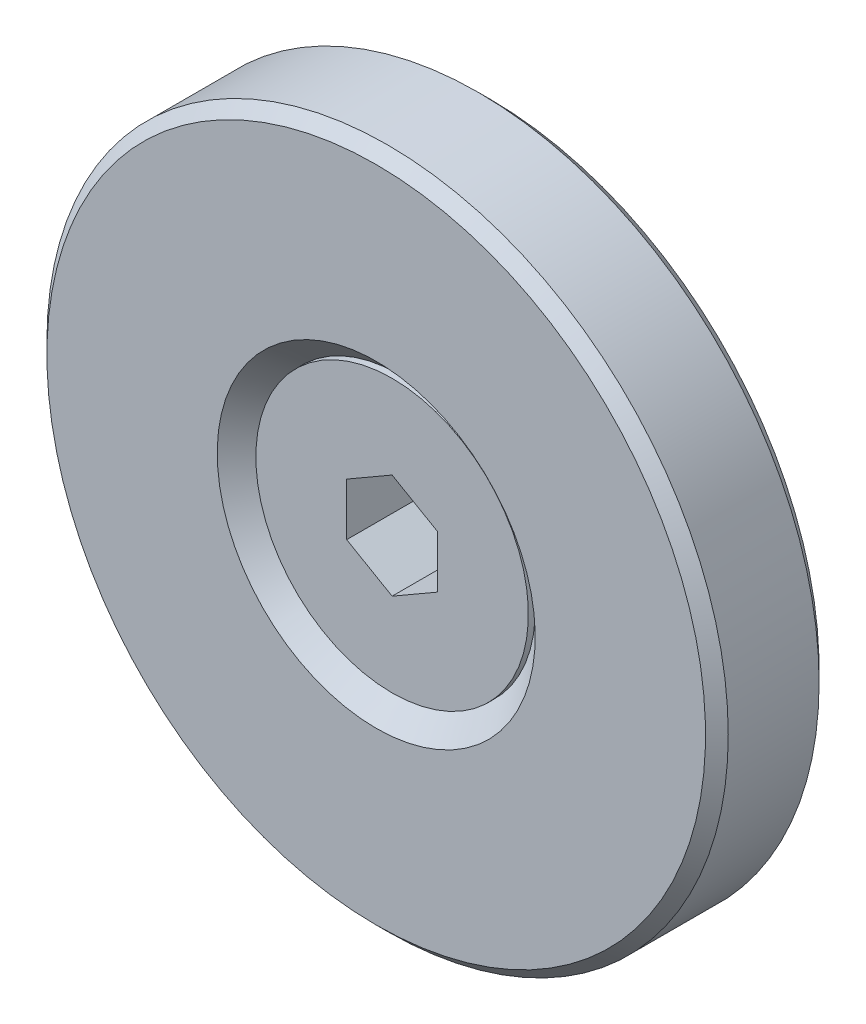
ISO-10303-21;
HEADER;
FILE_DESCRIPTION(('STEP AP214'),'2;1');
FILE_NAME('part.step','',(''),(''),'','','');
FILE_SCHEMA(('AUTOMOTIVE_DESIGN { 1 0 10303 214 1 1 1 1 }'));
ENDSEC;
DATA;
#1=APPLICATION_CONTEXT('core data for automotive mechanical design processes');
#2=APPLICATION_PROTOCOL_DEFINITION('international standard','automotive_design',2000,#1);
#3=PRODUCT_CONTEXT('',#1,'mechanical');
#4=PRODUCT('Part','Part','',(#3));
#5=PRODUCT_RELATED_PRODUCT_CATEGORY('part','',(#4));
#6=PRODUCT_DEFINITION_FORMATION('','',#4);
#7=PRODUCT_DEFINITION_CONTEXT('part definition',#1,'design');
#8=PRODUCT_DEFINITION('design','',#6,#7);
#9=PRODUCT_DEFINITION_SHAPE('','',#8);
#10=(LENGTH_UNIT() NAMED_UNIT(*) SI_UNIT(.MILLI.,.METRE.));
#11=(NAMED_UNIT(*) PLANE_ANGLE_UNIT() SI_UNIT($,.RADIAN.));
#12=(NAMED_UNIT(*) SI_UNIT($,.STERADIAN.) SOLID_ANGLE_UNIT());
#13=UNCERTAINTY_MEASURE_WITH_UNIT(LENGTH_MEASURE(1.E-05),#10,'distance_accuracy_value','');
#14=(GEOMETRIC_REPRESENTATION_CONTEXT(3) GLOBAL_UNCERTAINTY_ASSIGNED_CONTEXT((#13)) GLOBAL_UNIT_ASSIGNED_CONTEXT((#10,
#11,#12)) REPRESENTATION_CONTEXT('',''));
#15=CARTESIAN_POINT('',(0.,0.,0.));
#16=DIRECTION('',(0.,0.,1.));
#17=DIRECTION('',(1.,0.,0.));
#18=AXIS2_PLACEMENT_3D('',#15,#16,#17);
#19=CARTESIAN_POINT('',(0.,2.00000000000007,-7.7));
#20=DIRECTION('',(0.,0.,1.));
#21=DIRECTION('',(0.,-1.,0.));
#22=AXIS2_PLACEMENT_3D('',#19,#20,#21);
#23=PLANE('',#22);
#24=CARTESIAN_POINT('',(0.,0.,-7.7));
#25=DIRECTION('',(0.,0.,1.));
#26=DIRECTION('',(0.,-1.,0.));
#27=AXIS2_PLACEMENT_3D('',#24,#25,#26);
#28=CIRCLE('',#27,2.00000000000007);
#29=CARTESIAN_POINT('',(0.,-2.00000000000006,-7.7));
#30=VERTEX_POINT('',#29);
#31=EDGE_CURVE('E9',#30,#30,#28,.T.);
#32=ORIENTED_EDGE('',*,*,#31,.F.);
#33=EDGE_LOOP('',(#32));
#34=FACE_BOUND('',#33,.T.);
#35=ADVANCED_FACE('F14',(#34),#23,.F.);
#36=CARTESIAN_POINT('',(0.,0.,-7.7));
#37=DIRECTION('',(0.,0.,1.));
#38=DIRECTION('',(0.,-1.,0.));
#39=AXIS2_PLACEMENT_3D('',#36,#37,#38);
#40=CONICAL_SURFACE('',#39,2.00000000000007,0.785398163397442);
#41=CARTESIAN_POINT('',(0.,0.,-6.7));
#42=DIRECTION('',(0.,0.,1.));
#43=DIRECTION('',(0.,-1.,0.));
#44=AXIS2_PLACEMENT_3D('',#41,#42,#43);
#45=CIRCLE('',#44,3.00000000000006);
#46=CARTESIAN_POINT('',(0.,-3.00000000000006,-6.7));
#47=VERTEX_POINT('',#46);
#48=EDGE_CURVE('E21',#47,#47,#45,.T.);
#49=ORIENTED_EDGE('',*,*,#48,.F.);
#50=EDGE_LOOP('',(#49));
#51=FACE_BOUND('',#50,.T.);
#52=ORIENTED_EDGE('',*,*,#31,.T.);
#53=EDGE_LOOP('',(#52));
#54=FACE_BOUND('',#53,.T.);
#55=ADVANCED_FACE('F154',(#51,#54),#40,.T.);
#56=CARTESIAN_POINT('',(0.,0.,10.));
#57=DIRECTION('',(0.,0.,1.));
#58=DIRECTION('',(0.,-1.,0.));
#59=AXIS2_PLACEMENT_3D('',#56,#57,#58);
#60=CYLINDRICAL_SURFACE('',#59,3.00000000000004);
#61=CARTESIAN_POINT('',(0.,0.,1.00000000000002));
#62=DIRECTION('',(0.,0.,1.));
#63=DIRECTION('',(0.,-1.,0.));
#64=AXIS2_PLACEMENT_3D('',#61,#62,#63);
#65=CIRCLE('',#64,3.);
#66=CARTESIAN_POINT('',(0.,-3.,1.00000000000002));
#67=VERTEX_POINT('',#66);
#68=EDGE_CURVE('E147',#67,#67,#65,.T.);
#69=ORIENTED_EDGE('',*,*,#68,.F.);
#70=EDGE_LOOP('',(#69));
#71=FACE_BOUND('',#70,.T.);
#72=ORIENTED_EDGE('',*,*,#48,.T.);
#73=EDGE_LOOP('',(#72));
#74=FACE_BOUND('',#73,.T.);
#75=ADVANCED_FACE('F152',(#71,#74),#60,.T.);
#76=CARTESIAN_POINT('',(0.,0.,1.00000000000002));
#77=DIRECTION('',(0.,0.,1.));
#78=DIRECTION('',(0.,-1.,0.));
#79=AXIS2_PLACEMENT_3D('',#76,#77,#78);
#80=CONICAL_SURFACE('',#79,3.,0.785398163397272);
#81=CARTESIAN_POINT('',(0.,0.,1.19977548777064));
#82=DIRECTION('',(0.,0.,1.));
#83=DIRECTION('',(0.,-1.,0.));
#84=AXIS2_PLACEMENT_3D('',#81,#82,#83);
#85=CIRCLE('',#84,3.19977548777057);
#86=CARTESIAN_POINT('',(0.,-3.19977548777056,1.19977548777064));
#87=VERTEX_POINT('',#86);
#88=EDGE_CURVE('E144',#87,#87,#85,.T.);
#89=ORIENTED_EDGE('',*,*,#88,.F.);
#90=EDGE_LOOP('',(#89));
#91=FACE_BOUND('',#90,.T.);
#92=ORIENTED_EDGE('',*,*,#68,.T.);
#93=EDGE_LOOP('',(#92));
#94=FACE_BOUND('',#93,.T.);
#95=ADVANCED_FACE('F177',(#91,#94),#80,.T.);
#96=CARTESIAN_POINT('',(0.,0.,10.));
#97=DIRECTION('',(0.,0.,1.));
#98=DIRECTION('',(0.,-1.,0.));
#99=AXIS2_PLACEMENT_3D('',#96,#97,#98);
#100=CYLINDRICAL_SURFACE('',#99,3.19977548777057);
#101=CARTESIAN_POINT('',(0.,0.,0.));
#102=DIRECTION('',(0.,0.,1.));
#103=DIRECTION('',(0.,-1.,0.));
#104=AXIS2_PLACEMENT_3D('',#101,#102,#103);
#105=CIRCLE('',#104,3.19977548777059);
#106=CARTESIAN_POINT('',(0.,-3.19977548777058,0.));
#107=VERTEX_POINT('',#106);
#108=EDGE_CURVE('E141',#107,#107,#105,.T.);
#109=ORIENTED_EDGE('',*,*,#108,.F.);
#110=EDGE_LOOP('',(#109));
#111=FACE_BOUND('',#110,.T.);
#112=ORIENTED_EDGE('',*,*,#88,.T.);
#113=EDGE_LOOP('',(#112));
#114=FACE_BOUND('',#113,.T.);
#115=ADVANCED_FACE('F186',(#111,#114),#100,.F.);
#116=CARTESIAN_POINT('',(0.,3.19977548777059,0.));
#117=DIRECTION('',(0.,0.,1.));
#118=DIRECTION('',(0.,-1.,0.));
#119=AXIS2_PLACEMENT_3D('',#116,#117,#118);
#120=PLANE('',#119);
#121=CARTESIAN_POINT('',(0.,0.,0.));
#122=DIRECTION('',(0.,0.,1.));
#123=DIRECTION('',(0.,-1.,0.));
#124=AXIS2_PLACEMENT_3D('',#121,#122,#123);
#125=CIRCLE('',#124,14.5);
#126=CARTESIAN_POINT('',(0.,-14.5,0.));
#127=VERTEX_POINT('',#126);
#128=EDGE_CURVE('E138',#127,#127,#125,.T.);
#129=ORIENTED_EDGE('',*,*,#128,.F.);
#130=EDGE_LOOP('',(#129));
#131=FACE_BOUND('',#130,.T.);
#132=ORIENTED_EDGE('',*,*,#108,.T.);
#133=EDGE_LOOP('',(#132));
#134=FACE_BOUND('',#133,.T.);
#135=ADVANCED_FACE('F195',(#131,#134),#120,.F.);
#136=CARTESIAN_POINT('',(0.,0.,0.));
#137=DIRECTION('',(0.,0.,1.));
#138=DIRECTION('',(0.,-1.,0.));
#139=AXIS2_PLACEMENT_3D('',#136,#137,#138);
#140=CONICAL_SURFACE('',#139,14.5,0.785398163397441);
#141=CARTESIAN_POINT('',(0.,0.,0.500000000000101));
#142=DIRECTION('',(0.,0.,1.));
#143=DIRECTION('',(0.,-1.,0.));
#144=AXIS2_PLACEMENT_3D('',#141,#142,#143);
#145=CIRCLE('',#144,15.);
#146=CARTESIAN_POINT('',(0.,-15.,0.500000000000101));
#147=VERTEX_POINT('',#146);
#148=EDGE_CURVE('E135',#147,#147,#145,.T.);
#149=ORIENTED_EDGE('',*,*,#148,.F.);
#150=EDGE_LOOP('',(#149));
#151=FACE_BOUND('',#150,.T.);
#152=ORIENTED_EDGE('',*,*,#128,.T.);
#153=EDGE_LOOP('',(#152));
#154=FACE_BOUND('',#153,.T.);
#155=ADVANCED_FACE('F204',(#151,#154),#140,.T.);
#156=CARTESIAN_POINT('',(0.,0.,10.));
#157=DIRECTION('',(0.,0.,1.));
#158=DIRECTION('',(0.,-1.,0.));
#159=AXIS2_PLACEMENT_3D('',#156,#157,#158);
#160=CYLINDRICAL_SURFACE('',#159,15.);
#161=CARTESIAN_POINT('',(0.,0.,4.50000000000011));
#162=DIRECTION('',(0.,0.,1.));
#163=DIRECTION('',(0.,-1.,0.));
#164=AXIS2_PLACEMENT_3D('',#161,#162,#163);
#165=CIRCLE('',#164,15.);
#166=CARTESIAN_POINT('',(0.,-15.,4.50000000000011));
#167=VERTEX_POINT('',#166);
#168=EDGE_CURVE('E132',#167,#167,#165,.T.);
#169=ORIENTED_EDGE('',*,*,#168,.F.);
#170=EDGE_LOOP('',(#169));
#171=FACE_BOUND('',#170,.T.);
#172=ORIENTED_EDGE('',*,*,#148,.T.);
#173=EDGE_LOOP('',(#172));
#174=FACE_BOUND('',#173,.T.);
#175=ADVANCED_FACE('F213',(#171,#174),#160,.T.);
#176=CARTESIAN_POINT('',(0.,0.,4.50000000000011));
#177=DIRECTION('',(0.,0.,-1.));
#178=DIRECTION('',(0.,1.,0.));
#179=AXIS2_PLACEMENT_3D('',#176,#177,#178);
#180=CONICAL_SURFACE('',#179,15.,0.785398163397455);
#181=CARTESIAN_POINT('',(0.,0.,5.0000000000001));
#182=DIRECTION('',(0.,0.,1.));
#183=DIRECTION('',(0.,-1.,0.));
#184=AXIS2_PLACEMENT_3D('',#181,#182,#183);
#185=CIRCLE('',#184,14.5);
#186=CARTESIAN_POINT('',(0.,-14.5,5.0000000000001));
#187=VERTEX_POINT('',#186);
#188=EDGE_CURVE('E129',#187,#187,#185,.T.);
#189=ORIENTED_EDGE('',*,*,#188,.F.);
#190=EDGE_LOOP('',(#189));
#191=FACE_BOUND('',#190,.T.);
#192=ORIENTED_EDGE('',*,*,#168,.T.);
#193=EDGE_LOOP('',(#192));
#194=FACE_BOUND('',#193,.T.);
#195=ADVANCED_FACE('F222',(#191,#194),#180,.T.);
#196=CARTESIAN_POINT('',(0.,14.5,5.00000000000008));
#197=DIRECTION('',(0.,0.,-1.));
#198=DIRECTION('',(0.,1.,0.));
#199=AXIS2_PLACEMENT_3D('',#196,#197,#198);
#200=PLANE('',#199);
#201=CARTESIAN_POINT('',(0.,0.,5.));
#202=DIRECTION('',(0.,0.,1.));
#203=DIRECTION('',(0.,-1.,0.));
#204=AXIS2_PLACEMENT_3D('',#201,#202,#203);
#205=CIRCLE('',#204,7.);
#206=CARTESIAN_POINT('',(0.,-7.,5.));
#207=VERTEX_POINT('',#206);
#208=EDGE_CURVE('E126',#207,#207,#205,.T.);
#209=ORIENTED_EDGE('',*,*,#208,.F.);
#210=EDGE_LOOP('',(#209));
#211=FACE_BOUND('',#210,.T.);
#212=ORIENTED_EDGE('',*,*,#188,.T.);
#213=EDGE_LOOP('',(#212));
#214=FACE_BOUND('',#213,.T.);
#215=ADVANCED_FACE('F231',(#211,#214),#200,.F.);
#216=CARTESIAN_POINT('',(0.,0.,5.));
#217=DIRECTION('',(0.,0.,1.));
#218=DIRECTION('',(0.,-1.,0.));
#219=AXIS2_PLACEMENT_3D('',#216,#217,#218);
#220=CONICAL_SURFACE('',#219,7.,0.785398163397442);
#221=CARTESIAN_POINT('',(0.,0.,4.0000000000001));
#222=DIRECTION('',(0.,0.,1.));
#223=DIRECTION('',(0.,-1.,0.));
#224=AXIS2_PLACEMENT_3D('',#221,#222,#223);
#225=CIRCLE('',#224,6.);
#226=CARTESIAN_POINT('',(0.,-6.,4.0000000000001));
#227=VERTEX_POINT('',#226);
#228=EDGE_CURVE('E123',#227,#227,#225,.T.);
#229=ORIENTED_EDGE('',*,*,#228,.F.);
#230=EDGE_LOOP('',(#229));
#231=FACE_BOUND('',#230,.T.);
#232=ORIENTED_EDGE('',*,*,#208,.T.);
#233=EDGE_LOOP('',(#232));
#234=FACE_BOUND('',#233,.T.);
#235=ADVANCED_FACE('F240',(#231,#234),#220,.F.);
#236=CARTESIAN_POINT('',(0.,0.,10.));
#237=DIRECTION('',(0.,0.,1.));
#238=DIRECTION('',(0.,-1.,0.));
#239=AXIS2_PLACEMENT_3D('',#236,#237,#238);
#240=CYLINDRICAL_SURFACE('',#239,6.);
#241=CARTESIAN_POINT('',(0.,0.,4.3000000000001));
#242=DIRECTION('',(0.,0.,1.));
#243=DIRECTION('',(0.,-1.,0.));
#244=AXIS2_PLACEMENT_3D('',#241,#242,#243);
#245=CIRCLE('',#244,6.);
#246=CARTESIAN_POINT('',(0.,-6.,4.3000000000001));
#247=VERTEX_POINT('',#246);
#248=EDGE_CURVE('E115',#247,#247,#245,.T.);
#249=ORIENTED_EDGE('',*,*,#248,.F.);
#250=EDGE_LOOP('',(#249));
#251=FACE_BOUND('',#250,.T.);
#252=ORIENTED_EDGE('',*,*,#228,.T.);
#253=EDGE_LOOP('',(#252));
#254=FACE_BOUND('',#253,.T.);
#255=ADVANCED_FACE('F249',(#251,#254),#240,.T.);
#256=CARTESIAN_POINT('',(0.,0.,4.30000000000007));
#257=DIRECTION('',(0.,0.,-1.));
#258=DIRECTION('',(0.,1.,0.));
#259=AXIS2_PLACEMENT_3D('',#256,#257,#258);
#260=PLANE('',#259);
#261=DIRECTION('',(-0.866025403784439,-0.5,0.));
#262=VECTOR('',#261,1.);
#263=CARTESIAN_POINT('',(0.,2.30940107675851,4.30000000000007));
#264=LINE('',#263,#262);
#265=CARTESIAN_POINT('',(0.,2.30940107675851,4.30000000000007));
#266=VERTEX_POINT('',#265);
#267=CARTESIAN_POINT('',(-2.,1.15470053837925,4.30000000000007));
#268=VERTEX_POINT('',#267);
#269=EDGE_CURVE('E102',#266,#268,#264,.T.);
#270=ORIENTED_EDGE('',*,*,#269,.F.);
#271=DIRECTION('',(-0.866025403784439,0.5,0.));
#272=VECTOR('',#271,1.);
#273=CARTESIAN_POINT('',(2.,1.15470053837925,4.30000000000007));
#274=LINE('',#273,#272);
#275=CARTESIAN_POINT('',(2.,1.15470053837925,4.30000000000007));
#276=VERTEX_POINT('',#275);
#277=EDGE_CURVE('E28',#276,#266,#274,.T.);
#278=ORIENTED_EDGE('',*,*,#277,.F.);
#279=DIRECTION('',(0.,1.,0.));
#280=VECTOR('',#279,1.);
#281=CARTESIAN_POINT('',(2.,-1.15470053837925,4.30000000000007));
#282=LINE('',#281,#280);
#283=CARTESIAN_POINT('',(2.,-1.15470053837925,4.30000000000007));
#284=VERTEX_POINT('',#283);
#285=EDGE_CURVE('E111',#284,#276,#282,.T.);
#286=ORIENTED_EDGE('',*,*,#285,.F.);
#287=DIRECTION('',(0.866025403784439,0.5,0.));
#288=VECTOR('',#287,1.);
#289=CARTESIAN_POINT('',(0.,-2.30940107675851,4.30000000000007));
#290=LINE('',#289,#288);
#291=CARTESIAN_POINT('',(0.,-2.30940107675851,4.30000000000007));
#292=VERTEX_POINT('',#291);
#293=EDGE_CURVE('E109',#292,#284,#290,.T.);
#294=ORIENTED_EDGE('',*,*,#293,.F.);
#295=DIRECTION('',(0.866025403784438,-0.5,0.));
#296=VECTOR('',#295,1.);
#297=CARTESIAN_POINT('',(-2.,-1.15470053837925,4.30000000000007));
#298=LINE('',#297,#296);
#299=CARTESIAN_POINT('',(-2.,-1.15470053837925,4.30000000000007));
#300=VERTEX_POINT('',#299);
#301=EDGE_CURVE('E76',#300,#292,#298,.T.);
#302=ORIENTED_EDGE('',*,*,#301,.F.);
#303=DIRECTION('',(0.,-1.,0.));
#304=VECTOR('',#303,1.);
#305=CARTESIAN_POINT('',(-2.,1.15470053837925,4.30000000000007));
#306=LINE('',#305,#304);
#307=EDGE_CURVE('E105',#268,#300,#306,.T.);
#308=ORIENTED_EDGE('',*,*,#307,.F.);
#309=EDGE_LOOP('',(#270,#278,#286,#294,#302,#308));
#310=FACE_BOUND('',#309,.T.);
#311=ORIENTED_EDGE('',*,*,#248,.T.);
#312=EDGE_LOOP('',(#311));
#313=FACE_BOUND('',#312,.T.);
#314=ADVANCED_FACE('F258',(#310,#313),#260,.F.);
#315=CARTESIAN_POINT('',(2.,1.15470053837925,1.30000000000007));
#316=DIRECTION('',(0.5,0.866025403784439,0.));
#317=DIRECTION('',(0.866025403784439,-0.5,0.));
#318=AXIS2_PLACEMENT_3D('',#315,#316,#317);
#319=PLANE('',#318);
#320=ORIENTED_EDGE('',*,*,#277,.T.);
#321=DIRECTION('',(0.,0.,1.));
#322=VECTOR('',#321,1.);
#323=CARTESIAN_POINT('',(0.,2.30940107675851,1.30000000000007));
#324=LINE('',#323,#322);
#325=CARTESIAN_POINT('',(0.,2.30940107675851,1.30000000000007));
#326=VERTEX_POINT('',#325);
#327=EDGE_CURVE('E58',#326,#266,#324,.T.);
#328=ORIENTED_EDGE('',*,*,#327,.F.);
#329=DIRECTION('',(-0.866025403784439,0.5,0.));
#330=VECTOR('',#329,1.);
#331=CARTESIAN_POINT('',(2.,1.15470053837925,1.30000000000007));
#332=LINE('',#331,#330);
#333=CARTESIAN_POINT('',(2.,1.15470053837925,1.30000000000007));
#334=VERTEX_POINT('',#333);
#335=EDGE_CURVE('E113',#334,#326,#332,.T.);
#336=ORIENTED_EDGE('',*,*,#335,.F.);
#337=DIRECTION('',(0.,0.,1.));
#338=VECTOR('',#337,1.);
#339=CARTESIAN_POINT('',(2.,1.15470053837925,1.30000000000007));
#340=LINE('',#339,#338);
#341=EDGE_CURVE('E36',#334,#276,#340,.T.);
#342=ORIENTED_EDGE('',*,*,#341,.T.);
#343=EDGE_LOOP('',(#320,#328,#336,#342));
#344=FACE_BOUND('',#343,.T.);
#345=ADVANCED_FACE('F267',(#344),#319,.F.);
#346=CARTESIAN_POINT('',(2.,-1.15470053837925,1.30000000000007));
#347=DIRECTION('',(1.,0.,0.));
#348=DIRECTION('',(0.,-1.,0.));
#349=AXIS2_PLACEMENT_3D('',#346,#347,#348);
#350=PLANE('',#349);
#351=ORIENTED_EDGE('',*,*,#285,.T.);
#352=ORIENTED_EDGE('',*,*,#341,.F.);
#353=DIRECTION('',(0.,1.,0.));
#354=VECTOR('',#353,1.);
#355=CARTESIAN_POINT('',(2.,-1.15470053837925,1.30000000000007));
#356=LINE('',#355,#354);
#357=CARTESIAN_POINT('',(2.,-1.15470053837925,1.30000000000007));
#358=VERTEX_POINT('',#357);
#359=EDGE_CURVE('E88',#358,#334,#356,.T.);
#360=ORIENTED_EDGE('',*,*,#359,.F.);
#361=DIRECTION('',(0.,0.,1.));
#362=VECTOR('',#361,1.);
#363=CARTESIAN_POINT('',(2.,-1.15470053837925,1.30000000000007));
#364=LINE('',#363,#362);
#365=EDGE_CURVE('E80',#358,#284,#364,.T.);
#366=ORIENTED_EDGE('',*,*,#365,.T.);
#367=EDGE_LOOP('',(#351,#352,#360,#366));
#368=FACE_BOUND('',#367,.T.);
#369=ADVANCED_FACE('F276',(#368),#350,.F.);
#370=CARTESIAN_POINT('',(0.,-2.30940107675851,1.30000000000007));
#371=DIRECTION('',(0.5,-0.866025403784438,0.));
#372=DIRECTION('',(-0.866025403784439,-0.5,0.));
#373=AXIS2_PLACEMENT_3D('',#370,#371,#372);
#374=PLANE('',#373);
#375=ORIENTED_EDGE('',*,*,#293,.T.);
#376=ORIENTED_EDGE('',*,*,#365,.F.);
#377=DIRECTION('',(0.866025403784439,0.5,0.));
#378=VECTOR('',#377,1.);
#379=CARTESIAN_POINT('',(0.,-2.30940107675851,1.30000000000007));
#380=LINE('',#379,#378);
#381=CARTESIAN_POINT('',(0.,-2.30940107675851,1.30000000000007));
#382=VERTEX_POINT('',#381);
#383=EDGE_CURVE('E84',#382,#358,#380,.T.);
#384=ORIENTED_EDGE('',*,*,#383,.F.);
#385=DIRECTION('',(0.,0.,1.));
#386=VECTOR('',#385,1.);
#387=CARTESIAN_POINT('',(0.,-2.30940107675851,1.30000000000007));
#388=LINE('',#387,#386);
#389=EDGE_CURVE('E69',#382,#292,#388,.T.);
#390=ORIENTED_EDGE('',*,*,#389,.T.);
#391=EDGE_LOOP('',(#375,#376,#384,#390));
#392=FACE_BOUND('',#391,.T.);
#393=ADVANCED_FACE('F85',(#392),#374,.F.);
#394=CARTESIAN_POINT('',(-2.,-1.15470053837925,1.30000000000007));
#395=DIRECTION('',(-0.5,-0.866025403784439,0.));
#396=DIRECTION('',(-0.866025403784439,0.5,0.));
#397=AXIS2_PLACEMENT_3D('',#394,#395,#396);
#398=PLANE('',#397);
#399=ORIENTED_EDGE('',*,*,#301,.T.);
#400=ORIENTED_EDGE('',*,*,#389,.F.);
#401=DIRECTION('',(0.866025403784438,-0.5,0.));
#402=VECTOR('',#401,1.);
#403=CARTESIAN_POINT('',(-2.,-1.15470053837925,1.30000000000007));
#404=LINE('',#403,#402);
#405=CARTESIAN_POINT('',(-2.,-1.15470053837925,1.30000000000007));
#406=VERTEX_POINT('',#405);
#407=EDGE_CURVE('E73',#406,#382,#404,.T.);
#408=ORIENTED_EDGE('',*,*,#407,.F.);
#409=DIRECTION('',(0.,0.,1.));
#410=VECTOR('',#409,1.);
#411=CARTESIAN_POINT('',(-2.,-1.15470053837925,1.30000000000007));
#412=LINE('',#411,#410);
#413=EDGE_CURVE('E81',#406,#300,#412,.T.);
#414=ORIENTED_EDGE('',*,*,#413,.T.);
#415=EDGE_LOOP('',(#399,#400,#408,#414));
#416=FACE_BOUND('',#415,.T.);
#417=ADVANCED_FACE('F71',(#416),#398,.F.);
#418=CARTESIAN_POINT('',(-2.,1.15470053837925,1.30000000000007));
#419=DIRECTION('',(-1.,0.,0.));
#420=DIRECTION('',(0.,1.,0.));
#421=AXIS2_PLACEMENT_3D('',#418,#419,#420);
#422=PLANE('',#421);
#423=ORIENTED_EDGE('',*,*,#307,.T.);
#424=ORIENTED_EDGE('',*,*,#413,.F.);
#425=DIRECTION('',(0.,-1.,0.));
#426=VECTOR('',#425,1.);
#427=CARTESIAN_POINT('',(-2.,1.15470053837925,1.30000000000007));
#428=LINE('',#427,#426);
#429=CARTESIAN_POINT('',(-2.,1.15470053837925,1.30000000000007));
#430=VERTEX_POINT('',#429);
#431=EDGE_CURVE('E94',#430,#406,#428,.T.);
#432=ORIENTED_EDGE('',*,*,#431,.F.);
#433=DIRECTION('',(0.,0.,1.));
#434=VECTOR('',#433,1.);
#435=CARTESIAN_POINT('',(-2.,1.15470053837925,1.30000000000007));
#436=LINE('',#435,#434);
#437=EDGE_CURVE('E118',#430,#268,#436,.T.);
#438=ORIENTED_EDGE('',*,*,#437,.T.);
#439=EDGE_LOOP('',(#423,#424,#432,#438));
#440=FACE_BOUND('',#439,.T.);
#441=ADVANCED_FACE('F298',(#440),#422,.F.);
#442=CARTESIAN_POINT('',(0.,2.30940107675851,1.30000000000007));
#443=DIRECTION('',(-0.5,0.866025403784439,0.));
#444=DIRECTION('',(0.866025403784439,0.5,0.));
#445=AXIS2_PLACEMENT_3D('',#442,#443,#444);
#446=PLANE('',#445);
#447=ORIENTED_EDGE('',*,*,#269,.T.);
#448=ORIENTED_EDGE('',*,*,#437,.F.);
#449=DIRECTION('',(-0.866025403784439,-0.5,0.));
#450=VECTOR('',#449,1.);
#451=CARTESIAN_POINT('',(0.,2.30940107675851,1.30000000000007));
#452=LINE('',#451,#450);
#453=EDGE_CURVE('E96',#326,#430,#452,.T.);
#454=ORIENTED_EDGE('',*,*,#453,.F.);
#455=ORIENTED_EDGE('',*,*,#327,.T.);
#456=EDGE_LOOP('',(#447,#448,#454,#455));
#457=FACE_BOUND('',#456,.T.);
#458=ADVANCED_FACE('F306',(#457),#446,.F.);
#459=CARTESIAN_POINT('',(0.,2.30940107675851,1.30000000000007));
#460=DIRECTION('',(0.,0.,1.));
#461=DIRECTION('',(0.,-1.,0.));
#462=AXIS2_PLACEMENT_3D('',#459,#460,#461);
#463=PLANE('',#462);
#464=ORIENTED_EDGE('',*,*,#335,.T.);
#465=ORIENTED_EDGE('',*,*,#453,.T.);
#466=ORIENTED_EDGE('',*,*,#431,.T.);
#467=ORIENTED_EDGE('',*,*,#407,.T.);
#468=ORIENTED_EDGE('',*,*,#383,.T.);
#469=ORIENTED_EDGE('',*,*,#359,.T.);
#470=EDGE_LOOP('',(#464,#465,#466,#467,#468,#469));
#471=FACE_BOUND('',#470,.T.);
#472=ADVANCED_FACE('F91',(#471),#463,.T.);
#473=CLOSED_SHELL('',(#35,#55,#75,#95,#115,#135,#155,#175,#195,#215,#235,#255,#314,#345,#369,
#393,#417,#441,#458,#472));
#474=MANIFOLD_SOLID_BREP('B1',#473);
#475=ADVANCED_BREP_SHAPE_REPRESENTATION('',(#18,#474),#14);
#476=SHAPE_DEFINITION_REPRESENTATION(#9,#475);
ENDSEC;
END-ISO-10303-21;
